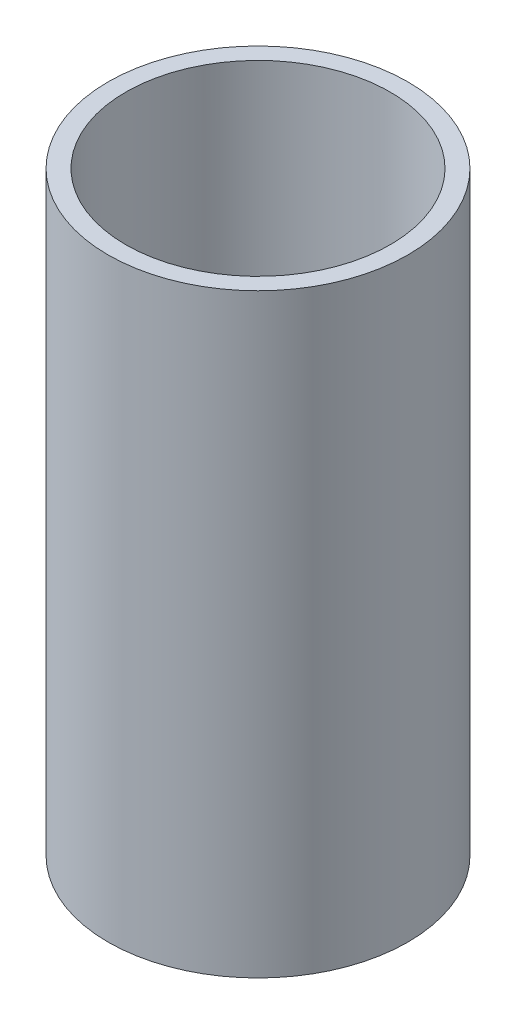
ISO-10303-21;
HEADER;
FILE_DESCRIPTION(('STEP AP214'),'2;1');
FILE_NAME('part.step','',(''),(''),'','','');
FILE_SCHEMA(('AUTOMOTIVE_DESIGN { 1 0 10303 214 1 1 1 1 }'));
ENDSEC;
DATA;
#1=APPLICATION_CONTEXT('core data for automotive mechanical design processes');
#2=APPLICATION_PROTOCOL_DEFINITION('international standard','automotive_design',2000,#1);
#3=PRODUCT_CONTEXT('',#1,'mechanical');
#4=PRODUCT('Part','Part','',(#3));
#5=PRODUCT_RELATED_PRODUCT_CATEGORY('part','',(#4));
#6=PRODUCT_DEFINITION_FORMATION('','',#4);
#7=PRODUCT_DEFINITION_CONTEXT('part definition',#1,'design');
#8=PRODUCT_DEFINITION('design','',#6,#7);
#9=PRODUCT_DEFINITION_SHAPE('','',#8);
#10=(LENGTH_UNIT() NAMED_UNIT(*) SI_UNIT(.MILLI.,.METRE.));
#11=(NAMED_UNIT(*) PLANE_ANGLE_UNIT() SI_UNIT($,.RADIAN.));
#12=(NAMED_UNIT(*) SI_UNIT($,.STERADIAN.) SOLID_ANGLE_UNIT());
#13=UNCERTAINTY_MEASURE_WITH_UNIT(LENGTH_MEASURE(1.E-05),#10,'distance_accuracy_value','');
#14=(GEOMETRIC_REPRESENTATION_CONTEXT(3) GLOBAL_UNCERTAINTY_ASSIGNED_CONTEXT((#13)) GLOBAL_UNIT_ASSIGNED_CONTEXT((#10,
#11,#12)) REPRESENTATION_CONTEXT('',''));
#15=CARTESIAN_POINT('',(0.,0.,0.));
#16=DIRECTION('',(0.,0.,1.));
#17=DIRECTION('',(1.,0.,0.));
#18=AXIS2_PLACEMENT_3D('',#15,#16,#17);
#19=CARTESIAN_POINT('',(0.,0.,0.));
#20=DIRECTION('',(0.,1.,0.));
#21=DIRECTION('',(0.,0.,1.));
#22=AXIS2_PLACEMENT_3D('',#19,#20,#21);
#23=CYLINDRICAL_SURFACE('',#22,38.1);
#24=CARTESIAN_POINT('',(0.,171.45,0.));
#25=DIRECTION('',(0.,1.,0.));
#26=DIRECTION('',(0.,0.,1.));
#27=AXIS2_PLACEMENT_3D('',#24,#25,#26);
#28=CIRCLE('',#27,38.1);
#29=CARTESIAN_POINT('',(0.,171.45,38.1));
#30=VERTEX_POINT('',#29);
#31=EDGE_CURVE('E94',#30,#30,#28,.T.);
#32=ORIENTED_EDGE('',*,*,#31,.T.);
#33=EDGE_LOOP('',(#32));
#34=FACE_BOUND('',#33,.T.);
#35=DIRECTION('',(0.,1.,0.));
#36=VECTOR('',#35,1.);
#37=CARTESIAN_POINT('',(37.5671066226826,0.,6.35));
#38=LINE('',#37,#36);
#39=CARTESIAN_POINT('',(37.5671066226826,0.,6.35));
#40=VERTEX_POINT('',#39);
#41=CARTESIAN_POINT('',(37.5671066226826,6.35,6.35));
#42=VERTEX_POINT('',#41);
#43=EDGE_CURVE('E11',#40,#42,#38,.T.);
#44=ORIENTED_EDGE('',*,*,#43,.F.);
#45=CARTESIAN_POINT('',(0.,0.,0.));
#46=DIRECTION('',(0.,1.,0.));
#47=DIRECTION('',(0.,0.,1.));
#48=AXIS2_PLACEMENT_3D('',#45,#46,#47);
#49=CIRCLE('',#48,38.1);
#50=CARTESIAN_POINT('',(37.5671066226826,0.,-6.35));
#51=VERTEX_POINT('',#50);
#52=EDGE_CURVE('E52',#51,#40,#49,.T.);
#53=ORIENTED_EDGE('',*,*,#52,.F.);
#54=DIRECTION('',(0.,1.,0.));
#55=VECTOR('',#54,1.);
#56=CARTESIAN_POINT('',(37.5671066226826,0.,-6.35));
#57=LINE('',#56,#55);
#58=CARTESIAN_POINT('',(37.5671066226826,6.35,-6.35));
#59=VERTEX_POINT('',#58);
#60=EDGE_CURVE('E41',#59,#51,#57,.F.);
#61=ORIENTED_EDGE('',*,*,#60,.F.);
#62=CARTESIAN_POINT('',(0.,6.35,0.));
#63=DIRECTION('',(0.,-1.,0.));
#64=DIRECTION('',(0.,0.,-1.));
#65=AXIS2_PLACEMENT_3D('',#62,#63,#64);
#66=CIRCLE('',#65,38.1);
#67=EDGE_CURVE('E48',#42,#59,#66,.F.);
#68=ORIENTED_EDGE('',*,*,#67,.F.);
#69=EDGE_LOOP('',(#44,#53,#61,#68));
#70=FACE_BOUND('',#69,.T.);
#71=ADVANCED_FACE('F33',(#34,#70),#23,.F.);
#72=CARTESIAN_POINT('',(0.,171.45,0.));
#73=DIRECTION('',(0.,-1.,0.));
#74=DIRECTION('',(0.,0.,-1.));
#75=AXIS2_PLACEMENT_3D('',#72,#73,#74);
#76=CYLINDRICAL_SURFACE('',#75,43.18);
#77=CARTESIAN_POINT('',(0.,171.45,0.));
#78=DIRECTION('',(0.,1.,0.));
#79=DIRECTION('',(0.,0.,1.));
#80=AXIS2_PLACEMENT_3D('',#77,#78,#79);
#81=CIRCLE('',#80,43.18);
#82=CARTESIAN_POINT('',(0.,171.45,43.18));
#83=VERTEX_POINT('',#82);
#84=EDGE_CURVE('E104',#83,#83,#81,.T.);
#85=ORIENTED_EDGE('',*,*,#84,.F.);
#86=EDGE_LOOP('',(#85));
#87=FACE_BOUND('',#86,.T.);
#88=CARTESIAN_POINT('',(0.,0.,0.));
#89=DIRECTION('',(0.,1.,0.));
#90=DIRECTION('',(0.,0.,1.));
#91=AXIS2_PLACEMENT_3D('',#88,#89,#90);
#92=CIRCLE('',#91,43.18);
#93=CARTESIAN_POINT('',(0.,0.,43.18));
#94=VERTEX_POINT('',#93);
#95=EDGE_CURVE('E102',#94,#94,#92,.T.);
#96=ORIENTED_EDGE('',*,*,#95,.T.);
#97=EDGE_LOOP('',(#96));
#98=FACE_BOUND('',#97,.T.);
#99=ADVANCED_FACE('F35',(#87,#98),#76,.T.);
#100=CARTESIAN_POINT('',(0.,171.45,0.));
#101=DIRECTION('',(0.,1.,0.));
#102=DIRECTION('',(0.,0.,1.));
#103=AXIS2_PLACEMENT_3D('',#100,#101,#102);
#104=PLANE('',#103);
#105=ORIENTED_EDGE('',*,*,#31,.F.);
#106=EDGE_LOOP('',(#105));
#107=FACE_BOUND('',#106,.T.);
#108=ORIENTED_EDGE('',*,*,#84,.T.);
#109=EDGE_LOOP('',(#108));
#110=FACE_BOUND('',#109,.T.);
#111=ADVANCED_FACE('F125',(#107,#110),#104,.T.);
#112=CARTESIAN_POINT('',(0.,0.,0.));
#113=DIRECTION('',(0.,1.,0.));
#114=DIRECTION('',(0.,0.,1.));
#115=AXIS2_PLACEMENT_3D('',#112,#113,#114);
#116=PLANE('',#115);
#117=ORIENTED_EDGE('',*,*,#52,.T.);
#118=DIRECTION('',(1.,0.,0.));
#119=VECTOR('',#118,1.);
#120=CARTESIAN_POINT('',(35.56,0.,6.35));
#121=LINE('',#120,#119);
#122=CARTESIAN_POINT('',(35.56,0.,6.35));
#123=VERTEX_POINT('',#122);
#124=EDGE_CURVE('E79',#123,#40,#121,.T.);
#125=ORIENTED_EDGE('',*,*,#124,.F.);
#126=DIRECTION('',(0.,0.,1.));
#127=VECTOR('',#126,1.);
#128=CARTESIAN_POINT('',(35.56,0.,-6.35));
#129=LINE('',#128,#127);
#130=CARTESIAN_POINT('',(35.56,0.,-6.35));
#131=VERTEX_POINT('',#130);
#132=EDGE_CURVE('E72',#131,#123,#129,.T.);
#133=ORIENTED_EDGE('',*,*,#132,.F.);
#134=DIRECTION('',(1.,0.,0.));
#135=VECTOR('',#134,1.);
#136=CARTESIAN_POINT('',(35.56,0.,-6.35));
#137=LINE('',#136,#135);
#138=EDGE_CURVE('E77',#131,#51,#137,.T.);
#139=ORIENTED_EDGE('',*,*,#138,.T.);
#140=EDGE_LOOP('',(#117,#125,#133,#139));
#141=FACE_BOUND('',#140,.T.);
#142=ORIENTED_EDGE('',*,*,#95,.F.);
#143=EDGE_LOOP('',(#142));
#144=FACE_BOUND('',#143,.T.);
#145=ADVANCED_FACE('F74',(#141,#144),#116,.F.);
#146=CARTESIAN_POINT('',(35.56,0.,-6.35));
#147=DIRECTION('',(0.,0.,1.));
#148=DIRECTION('',(1.,0.,0.));
#149=AXIS2_PLACEMENT_3D('',#146,#147,#148);
#150=PLANE('',#149);
#151=DIRECTION('',(1.,0.,0.));
#152=VECTOR('',#151,1.);
#153=CARTESIAN_POINT('',(35.56,6.35,-6.35));
#154=LINE('',#153,#152);
#155=CARTESIAN_POINT('',(35.56,6.35,-6.35));
#156=VERTEX_POINT('',#155);
#157=EDGE_CURVE('E112',#156,#59,#154,.T.);
#158=ORIENTED_EDGE('',*,*,#157,.T.);
#159=ORIENTED_EDGE('',*,*,#60,.T.);
#160=ORIENTED_EDGE('',*,*,#138,.F.);
#161=DIRECTION('',(0.,-1.,0.));
#162=VECTOR('',#161,1.);
#163=CARTESIAN_POINT('',(35.56,0.,-6.35));
#164=LINE('',#163,#162);
#165=EDGE_CURVE('E83',#156,#131,#164,.T.);
#166=ORIENTED_EDGE('',*,*,#165,.F.);
#167=EDGE_LOOP('',(#158,#159,#160,#166));
#168=FACE_BOUND('',#167,.T.);
#169=ADVANCED_FACE('F93',(#168),#150,.F.);
#170=CARTESIAN_POINT('',(35.56,0.,6.35));
#171=DIRECTION('',(0.,0.,-1.));
#172=DIRECTION('',(-1.,0.,0.));
#173=AXIS2_PLACEMENT_3D('',#170,#171,#172);
#174=PLANE('',#173);
#175=ORIENTED_EDGE('',*,*,#124,.T.);
#176=ORIENTED_EDGE('',*,*,#43,.T.);
#177=DIRECTION('',(1.,0.,0.));
#178=VECTOR('',#177,1.);
#179=CARTESIAN_POINT('',(35.56,6.35,6.35));
#180=LINE('',#179,#178);
#181=CARTESIAN_POINT('',(35.56,6.35,6.35));
#182=VERTEX_POINT('',#181);
#183=EDGE_CURVE('E98',#182,#42,#180,.T.);
#184=ORIENTED_EDGE('',*,*,#183,.F.);
#185=DIRECTION('',(0.,1.,0.));
#186=VECTOR('',#185,1.);
#187=CARTESIAN_POINT('',(35.56,0.,6.35));
#188=LINE('',#187,#186);
#189=EDGE_CURVE('E82',#123,#182,#188,.T.);
#190=ORIENTED_EDGE('',*,*,#189,.F.);
#191=EDGE_LOOP('',(#175,#176,#184,#190));
#192=FACE_BOUND('',#191,.T.);
#193=ADVANCED_FACE('F118',(#192),#174,.F.);
#194=CARTESIAN_POINT('',(35.56,6.35,-6.35));
#195=DIRECTION('',(0.,-1.,0.));
#196=DIRECTION('',(0.,0.,-1.));
#197=AXIS2_PLACEMENT_3D('',#194,#195,#196);
#198=PLANE('',#197);
#199=ORIENTED_EDGE('',*,*,#183,.T.);
#200=ORIENTED_EDGE('',*,*,#67,.T.);
#201=ORIENTED_EDGE('',*,*,#157,.F.);
#202=DIRECTION('',(0.,0.,-1.));
#203=VECTOR('',#202,1.);
#204=CARTESIAN_POINT('',(35.56,6.35,-6.35));
#205=LINE('',#204,#203);
#206=EDGE_CURVE('E88',#182,#156,#205,.T.);
#207=ORIENTED_EDGE('',*,*,#206,.F.);
#208=EDGE_LOOP('',(#199,#200,#201,#207));
#209=FACE_BOUND('',#208,.T.);
#210=ADVANCED_FACE('F111',(#209),#198,.F.);
#211=CARTESIAN_POINT('',(35.56,0.,0.));
#212=DIRECTION('',(1.,0.,0.));
#213=DIRECTION('',(0.,0.,-1.));
#214=AXIS2_PLACEMENT_3D('',#211,#212,#213);
#215=PLANE('',#214);
#216=ORIENTED_EDGE('',*,*,#165,.T.);
#217=ORIENTED_EDGE('',*,*,#132,.T.);
#218=ORIENTED_EDGE('',*,*,#189,.T.);
#219=ORIENTED_EDGE('',*,*,#206,.T.);
#220=EDGE_LOOP('',(#216,#217,#218,#219));
#221=FACE_BOUND('',#220,.T.);
#222=ADVANCED_FACE('F86',(#221),#215,.F.);
#223=CLOSED_SHELL('',(#71,#99,#111,#145,#169,#193,#210,#222));
#224=MANIFOLD_SOLID_BREP('B2',#223);
#225=ADVANCED_BREP_SHAPE_REPRESENTATION('',(#18,#224),#14);
#226=SHAPE_DEFINITION_REPRESENTATION(#9,#225);
ENDSEC;
END-ISO-10303-21;
